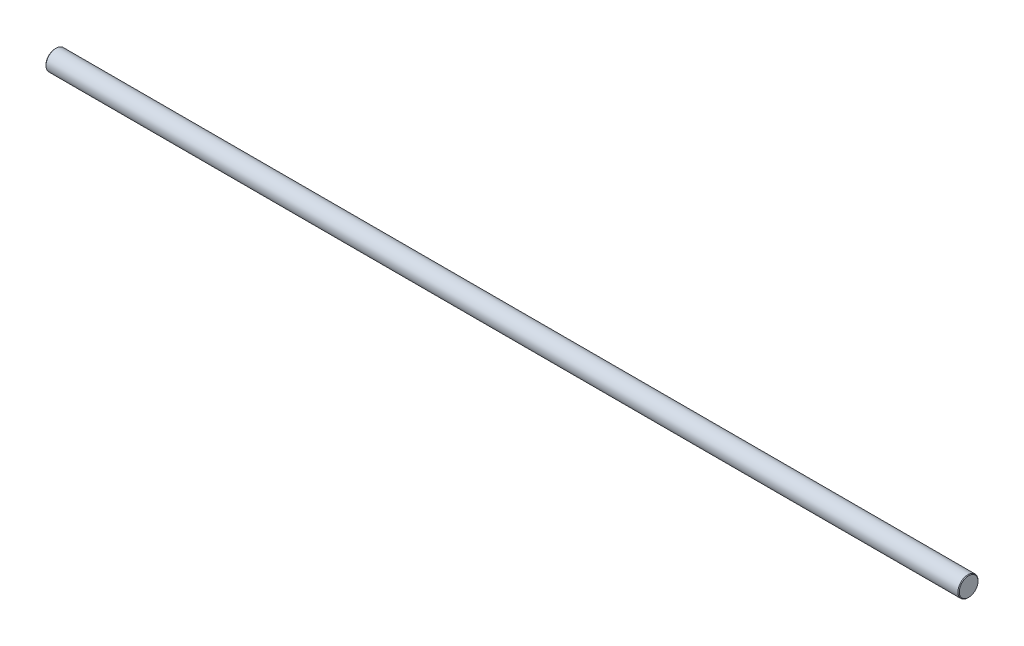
ISO-10303-21;
HEADER;
FILE_DESCRIPTION(('STEP AP214'),'2;1');
FILE_NAME('part.step','',(''),(''),'','','');
FILE_SCHEMA(('AUTOMOTIVE_DESIGN { 1 0 10303 214 1 1 1 1 }'));
ENDSEC;
DATA;
#1=APPLICATION_CONTEXT('core data for automotive mechanical design processes');
#2=APPLICATION_PROTOCOL_DEFINITION('international standard','automotive_design',2000,#1);
#3=PRODUCT_CONTEXT('',#1,'mechanical');
#4=PRODUCT('Part','Part','',(#3));
#5=PRODUCT_RELATED_PRODUCT_CATEGORY('part','',(#4));
#6=PRODUCT_DEFINITION_FORMATION('','',#4);
#7=PRODUCT_DEFINITION_CONTEXT('part definition',#1,'design');
#8=PRODUCT_DEFINITION('design','',#6,#7);
#9=PRODUCT_DEFINITION_SHAPE('','',#8);
#10=(LENGTH_UNIT() NAMED_UNIT(*) SI_UNIT(.MILLI.,.METRE.));
#11=(NAMED_UNIT(*) PLANE_ANGLE_UNIT() SI_UNIT($,.RADIAN.));
#12=(NAMED_UNIT(*) SI_UNIT($,.STERADIAN.) SOLID_ANGLE_UNIT());
#13=UNCERTAINTY_MEASURE_WITH_UNIT(LENGTH_MEASURE(1.E-05),#10,'distance_accuracy_value','');
#14=(GEOMETRIC_REPRESENTATION_CONTEXT(3) GLOBAL_UNCERTAINTY_ASSIGNED_CONTEXT((#13)) GLOBAL_UNIT_ASSIGNED_CONTEXT((#10,
#11,#12)) REPRESENTATION_CONTEXT('',''));
#15=CARTESIAN_POINT('',(0.,0.,0.));
#16=DIRECTION('',(0.,0.,1.));
#17=DIRECTION('',(1.,0.,0.));
#18=AXIS2_PLACEMENT_3D('',#15,#16,#17);
#19=CARTESIAN_POINT('',(340.5,7.50000000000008,0.));
#20=DIRECTION('',(-1.,0.,0.));
#21=DIRECTION('',(0.,0.,1.));
#22=AXIS2_PLACEMENT_3D('',#19,#20,#21);
#23=PLANE('',#22);
#24=CARTESIAN_POINT('',(340.5,0.,0.));
#25=DIRECTION('',(-1.,0.,0.));
#26=DIRECTION('',(0.,0.,1.));
#27=AXIS2_PLACEMENT_3D('',#24,#25,#26);
#28=CIRCLE('',#27,7.00000000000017);
#29=CARTESIAN_POINT('',(340.5,0.,7.00000000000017));
#30=VERTEX_POINT('',#29);
#31=EDGE_CURVE('E17',#30,#30,#28,.T.);
#32=ORIENTED_EDGE('',*,*,#31,.F.);
#33=EDGE_LOOP('',(#32));
#34=FACE_BOUND('',#33,.T.);
#35=ADVANCED_FACE('F14',(#34),#23,.F.);
#36=CARTESIAN_POINT('',(-340.5,7.5,0.));
#37=DIRECTION('',(1.,0.,0.));
#38=DIRECTION('',(0.,0.,-1.));
#39=AXIS2_PLACEMENT_3D('',#36,#37,#38);
#40=PLANE('',#39);
#41=CARTESIAN_POINT('',(-340.5,0.,0.));
#42=DIRECTION('',(1.,0.,0.));
#43=DIRECTION('',(0.,0.,-1.));
#44=AXIS2_PLACEMENT_3D('',#41,#42,#43);
#45=CIRCLE('',#44,7.00000000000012);
#46=CARTESIAN_POINT('',(-340.5,0.,-7.00000000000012));
#47=VERTEX_POINT('',#46);
#48=EDGE_CURVE('E26',#47,#47,#45,.T.);
#49=ORIENTED_EDGE('',*,*,#48,.F.);
#50=EDGE_LOOP('',(#49));
#51=FACE_BOUND('',#50,.T.);
#52=ADVANCED_FACE('F37',(#51),#40,.F.);
#53=CARTESIAN_POINT('',(340.,0.,0.));
#54=DIRECTION('',(-1.,0.,0.));
#55=DIRECTION('',(0.,0.,1.));
#56=AXIS2_PLACEMENT_3D('',#53,#54,#55);
#57=CONICAL_SURFACE('',#56,7.50000000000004,0.785398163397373);
#58=CARTESIAN_POINT('',(340.,0.,0.));
#59=DIRECTION('',(-1.,0.,0.));
#60=DIRECTION('',(0.,0.,1.));
#61=AXIS2_PLACEMENT_3D('',#58,#59,#60);
#62=CIRCLE('',#61,7.50000000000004);
#63=CARTESIAN_POINT('',(340.,0.,7.50000000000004));
#64=VERTEX_POINT('',#63);
#65=EDGE_CURVE('E21',#64,#64,#62,.T.);
#66=ORIENTED_EDGE('',*,*,#65,.F.);
#67=EDGE_LOOP('',(#66));
#68=FACE_BOUND('',#67,.T.);
#69=ORIENTED_EDGE('',*,*,#31,.T.);
#70=EDGE_LOOP('',(#69));
#71=FACE_BOUND('',#70,.T.);
#72=ADVANCED_FACE('F34',(#68,#71),#57,.T.);
#73=CARTESIAN_POINT('',(-340.,0.,0.));
#74=DIRECTION('',(1.,0.,0.));
#75=DIRECTION('',(0.,0.,-1.));
#76=AXIS2_PLACEMENT_3D('',#73,#74,#75);
#77=CONICAL_SURFACE('',#76,7.50000000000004,0.785398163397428);
#78=CARTESIAN_POINT('',(-340.,0.,0.));
#79=DIRECTION('',(-1.,0.,0.));
#80=DIRECTION('',(0.,0.,1.));
#81=AXIS2_PLACEMENT_3D('',#78,#79,#80);
#82=CIRCLE('',#81,7.50000000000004);
#83=CARTESIAN_POINT('',(-340.,0.,7.50000000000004));
#84=VERTEX_POINT('',#83);
#85=EDGE_CURVE('E10',#84,#84,#82,.F.);
#86=ORIENTED_EDGE('',*,*,#85,.F.);
#87=EDGE_LOOP('',(#86));
#88=FACE_BOUND('',#87,.T.);
#89=ORIENTED_EDGE('',*,*,#48,.T.);
#90=EDGE_LOOP('',(#89));
#91=FACE_BOUND('',#90,.T.);
#92=ADVANCED_FACE('F45',(#88,#91),#77,.T.);
#93=CARTESIAN_POINT('',(-381.251357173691,0.,0.));
#94=DIRECTION('',(-1.,0.,0.));
#95=DIRECTION('',(0.,0.,1.));
#96=AXIS2_PLACEMENT_3D('',#93,#94,#95);
#97=CYLINDRICAL_SURFACE('',#96,7.50000000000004);
#98=ORIENTED_EDGE('',*,*,#85,.T.);
#99=EDGE_LOOP('',(#98));
#100=FACE_BOUND('',#99,.T.);
#101=ORIENTED_EDGE('',*,*,#65,.T.);
#102=EDGE_LOOP('',(#101));
#103=FACE_BOUND('',#102,.T.);
#104=ADVANCED_FACE('F43',(#100,#103),#97,.T.);
#105=CLOSED_SHELL('',(#35,#52,#72,#92,#104));
#106=MANIFOLD_SOLID_BREP('B1',#105);
#107=ADVANCED_BREP_SHAPE_REPRESENTATION('',(#18,#106),#14);
#108=SHAPE_DEFINITION_REPRESENTATION(#9,#107);
ENDSEC;
END-ISO-10303-21;
